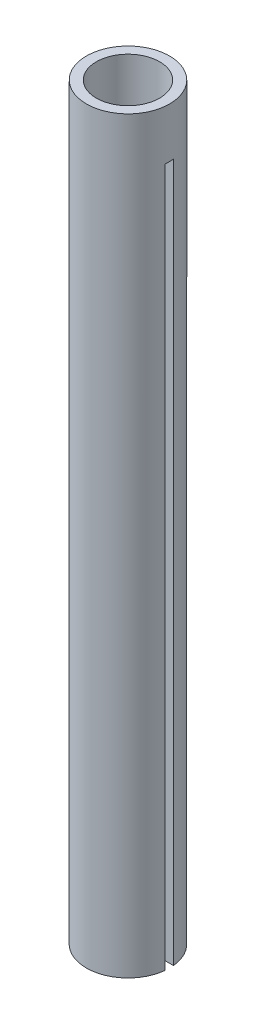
from build123d import *

# Parameters (mm, degrees)
ESQUISSE1_R             = 12.5
ESQUISSE1_R_2           = 9.5
BOSS_EXTRU_1_DEPTH      = 225
ESQUISSE2_W             = 2.5
ESQUISSE2_H             = 210
ENL_V_MAT_EXTRU_1_DEPTH = 226.693376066


with BuildPart() as part:
    # Esquisse1 → Boss.-Extru.1 (new body)
    with BuildSketch(Plane(origin=(0, 0, 0), x_dir=(1, 0, 0), z_dir=(0, 1, 0))):
        with Locations(Location((0, 0, 0), (0, 0, 270))):
            Circle(ESQUISSE1_R)
        with Locations(Location((0, 0, 0), (0, 0, 270))):
            Circle(ESQUISSE1_R_2, mode=Mode.SUBTRACT)
    extrude(amount=-BOSS_EXTRU_1_DEPTH)

    # Esquisse2 → Enl_v. mat.-Extru.1 (cut, through all)
    with BuildSketch(Plane(origin=(0, 0, 0), x_dir=(0, 0, -1), z_dir=(1, 0, 0))):
        with Locations((0, -120)):
            Rectangle(ESQUISSE2_W, ESQUISSE2_H)
    extrude(amount=ENL_V_MAT_EXTRU_1_DEPTH, mode=Mode.SUBTRACT)


solid = part.part
